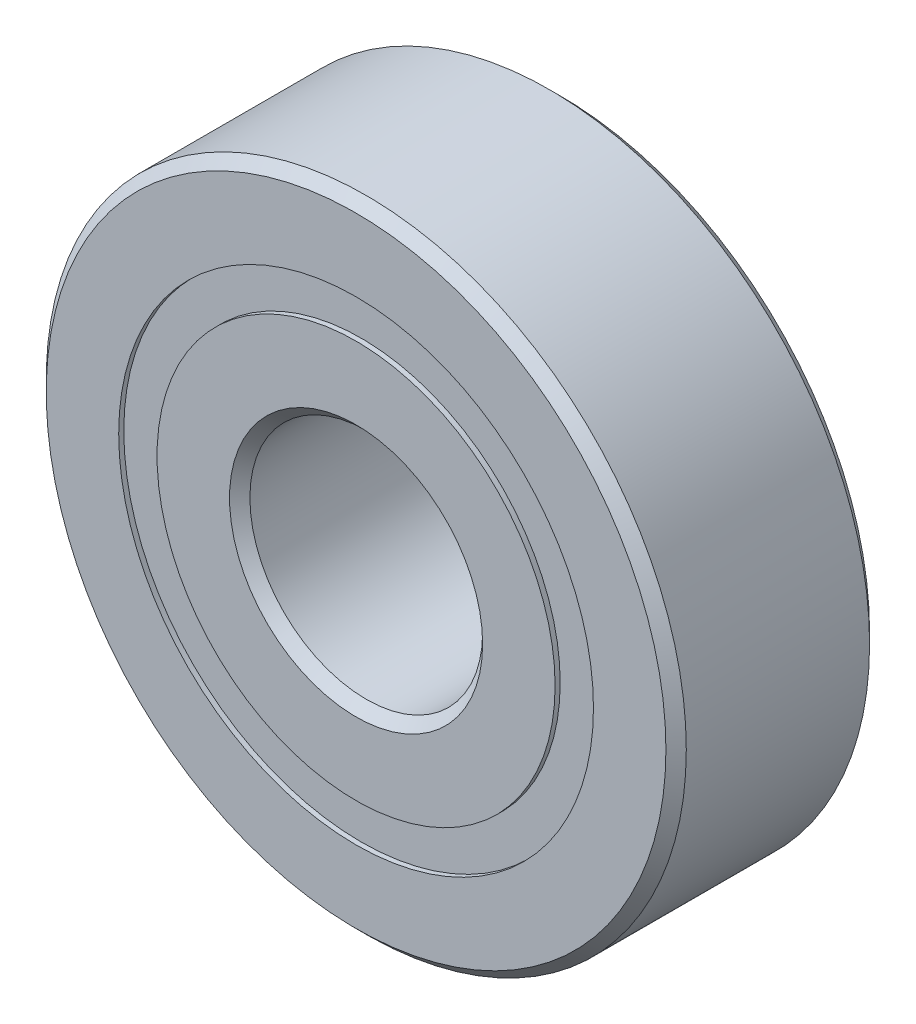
from build123d import *

# Parameters (mm, degrees)
CIRPATTERN1_COUNT = 10
SKETCH6_W         = 1.635478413
SKETCH6_H         = 1.318681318


with BuildPart() as part:
    # Sketch1 → Revolve1 (revolve)
    with BuildSketch(Plane(origin=(0, 0, 0), x_dir=(0, 0, -1), z_dir=(1, 0, 0)), mode=Mode.PRIVATE) as revolve1_sk:
        with BuildLine():
            Line((3.15, 11), (-3.15, 11))
            Line((-3.15, 11), (-3.5, 10.65))
            Line((-3.5, 10.65), (-3.5, 8.159340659))
            Line((-3.5, 8.159340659), (-1.555555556, 8.159340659))
            ThreePointArc((-1.555555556, 8.159340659), (0, 9.189521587), (1.555555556, 8.159340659))
            Line((1.555555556, 8.159340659), (3.5, 8.159340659))
            Line((3.5, 8.159340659), (3.5, 10.65))
            Line((3.5, 10.65), (3.15, 11))
        make_face()
    revolve(revolve1_sk.sketch.rotate(Axis((0, 0, 3.5), (0, 0, -1)), 90), axis=Axis((0, 0, 3.5), (0, 0, -1)))


with BuildPart() as body_2:
    # Sketch3 → Revolve3 (revolve)
    with BuildSketch(Plane(origin=(0, 0, 0), x_dir=(0, 0, -1), z_dir=(1, 0, 0)), mode=Mode.PRIVATE) as revolve3_sk:
        with BuildLine():
            Line((-3.5, 6.840659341), (-1.555555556, 6.840659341))
            ThreePointArc((-1.555555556, 6.840659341), (0, 5.810478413), (1.555555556, 6.840659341))
            Line((1.555555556, 6.840659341), (3.5, 6.840659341))
            Line((3.5, 6.840659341), (3.5, 4.35))
            Line((3.5, 4.35), (3.15, 4))
            Line((3.15, 4), (-3.15, 4))
            Line((-3.15, 4), (-3.5, 4.35))
            Line((-3.5, 4.35), (-3.5, 6.840659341))
        make_face()
    revolve(revolve3_sk.sketch.rotate(Axis((0, 0, 3.5), (0, 0, -1)), 90), axis=Axis((0, 0, 3.5), (0, 0, -1)))


with BuildPart() as body_3:
    # Sketch4 → Revolve4 (revolve)
    with BuildSketch(Plane(origin=(0, 0, 0), x_dir=(0, 0, -1), z_dir=(1, 0, 0))):
        with BuildLine():
            Line((-1.689521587, 7.5), (1.689521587, 7.5))
            ThreePointArc((1.689521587, 7.5), (0, 9.189521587), (-1.689521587, 7.5))
        make_face()
    revolve(axis=Axis((0, 7.5, 1.689521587), (0, 0, -1)))


with BuildPart() as cirpattern1_1:
    # CirPattern1: pattern copy
    add(body_3.part.rotate(Axis((0, 0, 0), (0, 0, 1)), 1 * 360 / CIRPATTERN1_COUNT))


with BuildPart() as cirpattern1_2:
    # CirPattern1: pattern copy
    add(body_3.part.rotate(Axis((0, 0, 0), (0, 0, 1)), 2 * 360 / CIRPATTERN1_COUNT))


with BuildPart() as cirpattern1_3:
    # CirPattern1: pattern copy
    add(body_3.part.rotate(Axis((0, 0, 0), (0, 0, 1)), 3 * 360 / CIRPATTERN1_COUNT))


with BuildPart() as cirpattern1_4:
    # CirPattern1: pattern copy
    add(body_3.part.rotate(Axis((0, 0, 0), (0, 0, 1)), 4 * 360 / CIRPATTERN1_COUNT))


with BuildPart() as cirpattern1_5:
    # CirPattern1: pattern copy
    add(body_3.part.rotate(Axis((0, 0, 0), (0, 0, 1)), 5 * 360 / CIRPATTERN1_COUNT))


with BuildPart() as cirpattern1_6:
    # CirPattern1: pattern copy
    add(body_3.part.rotate(Axis((0, 0, 0), (0, 0, 1)), 6 * 360 / CIRPATTERN1_COUNT))


with BuildPart() as cirpattern1_7:
    # CirPattern1: pattern copy
    add(body_3.part.rotate(Axis((0, 0, 0), (0, 0, 1)), 7 * 360 / CIRPATTERN1_COUNT))


with BuildPart() as cirpattern1_8:
    # CirPattern1: pattern copy
    add(body_3.part.rotate(Axis((0, 0, 0), (0, 0, 1)), 8 * 360 / CIRPATTERN1_COUNT))


with BuildPart() as cirpattern1_9:
    # CirPattern1: pattern copy
    add(body_3.part.rotate(Axis((0, 0, 0), (0, 0, 1)), 9 * 360 / CIRPATTERN1_COUNT))


with BuildPart() as body_13:
    # Sketch6 → Revolve5 (revolve)
    with BuildSketch(Plane(origin=(0, 0, 0), x_dir=(0, 0, -1), z_dir=(1, 0, 0)), mode=Mode.PRIVATE) as revolve5_sk:
        with Locations((-2.507260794, 7.5)):
            Rectangle(SKETCH6_W, SKETCH6_H)
        with Locations((2.507260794, 7.5)):
            Rectangle(SKETCH6_W, SKETCH6_H)
    revolve(revolve5_sk.sketch.rotate(Axis((0, 0, 3.5), (0, 0, -1)), 90), axis=Axis((0, 0, 3.5), (0, 0, -1)))


solid = Compound([part.part, body_2.part, body_3.part, cirpattern1_1.part, cirpattern1_2.part, cirpattern1_3.part, cirpattern1_4.part, cirpattern1_5.part, cirpattern1_6.part, cirpattern1_7.part, cirpattern1_8.part, cirpattern1_9.part, body_13.part])
